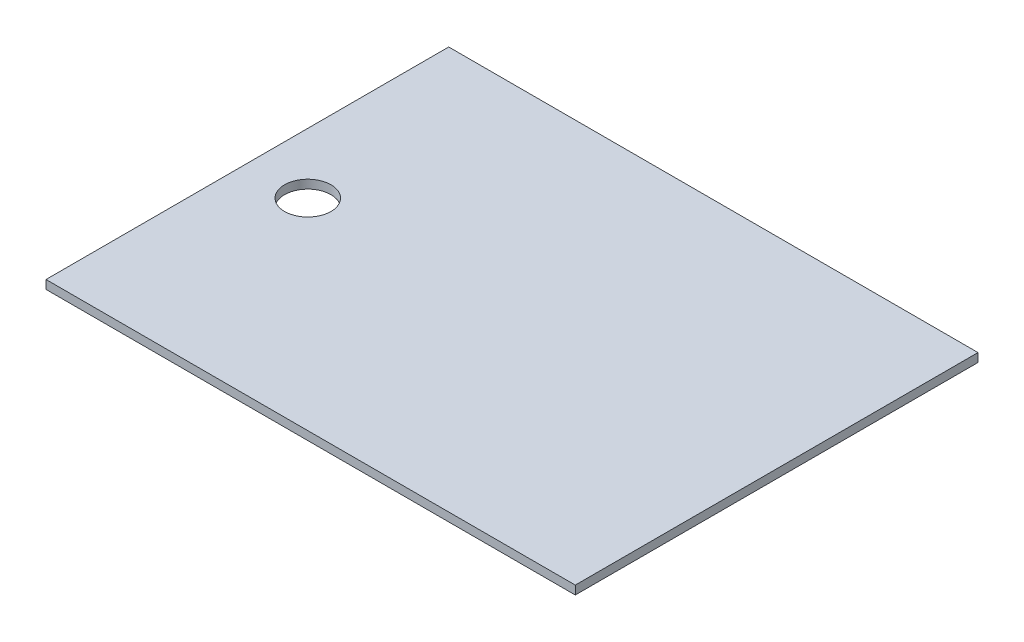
ISO-10303-21;
HEADER;
FILE_DESCRIPTION(('STEP AP214'),'2;1');
FILE_NAME('part.step','',(''),(''),'','','');
FILE_SCHEMA(('AUTOMOTIVE_DESIGN { 1 0 10303 214 1 1 1 1 }'));
ENDSEC;
DATA;
#1=APPLICATION_CONTEXT('core data for automotive mechanical design processes');
#2=APPLICATION_PROTOCOL_DEFINITION('international standard','automotive_design',2000,#1);
#3=PRODUCT_CONTEXT('',#1,'mechanical');
#4=PRODUCT('Part','Part','',(#3));
#5=PRODUCT_RELATED_PRODUCT_CATEGORY('part','',(#4));
#6=PRODUCT_DEFINITION_FORMATION('','',#4);
#7=PRODUCT_DEFINITION_CONTEXT('part definition',#1,'design');
#8=PRODUCT_DEFINITION('design','',#6,#7);
#9=PRODUCT_DEFINITION_SHAPE('','',#8);
#10=(LENGTH_UNIT() NAMED_UNIT(*) SI_UNIT(.MILLI.,.METRE.));
#11=(NAMED_UNIT(*) PLANE_ANGLE_UNIT() SI_UNIT($,.RADIAN.));
#12=(NAMED_UNIT(*) SI_UNIT($,.STERADIAN.) SOLID_ANGLE_UNIT());
#13=UNCERTAINTY_MEASURE_WITH_UNIT(LENGTH_MEASURE(1.E-05),#10,'distance_accuracy_value','');
#14=(GEOMETRIC_REPRESENTATION_CONTEXT(3) GLOBAL_UNCERTAINTY_ASSIGNED_CONTEXT((#13)) GLOBAL_UNIT_ASSIGNED_CONTEXT((#10,
#11,#12)) REPRESENTATION_CONTEXT('',''));
#15=CARTESIAN_POINT('',(0.,0.,0.));
#16=DIRECTION('',(0.,0.,1.));
#17=DIRECTION('',(1.,0.,0.));
#18=AXIS2_PLACEMENT_3D('',#15,#16,#17);
#19=CARTESIAN_POINT('',(584.2,19.05,-444.5));
#20=DIRECTION('',(-1.,0.,0.));
#21=DIRECTION('',(0.,0.,1.));
#22=AXIS2_PLACEMENT_3D('',#19,#20,#21);
#23=PLANE('',#22);
#24=DIRECTION('',(0.,0.,-1.));
#25=VECTOR('',#24,1.);
#26=CARTESIAN_POINT('',(584.2,0.,-444.5));
#27=LINE('',#26,#25);
#28=CARTESIAN_POINT('',(584.2,0.,444.5));
#29=VERTEX_POINT('',#28);
#30=CARTESIAN_POINT('',(584.2,0.,-444.5));
#31=VERTEX_POINT('',#30);
#32=EDGE_CURVE('E102',#29,#31,#27,.T.);
#33=ORIENTED_EDGE('',*,*,#32,.T.);
#34=DIRECTION('',(0.,-1.,0.));
#35=VECTOR('',#34,1.);
#36=CARTESIAN_POINT('',(584.2,19.05,-444.5));
#37=LINE('',#36,#35);
#38=CARTESIAN_POINT('',(584.2,19.05,-444.5));
#39=VERTEX_POINT('',#38);
#40=EDGE_CURVE('E11',#39,#31,#37,.T.);
#41=ORIENTED_EDGE('',*,*,#40,.F.);
#42=DIRECTION('',(0.,0.,-1.));
#43=VECTOR('',#42,1.);
#44=CARTESIAN_POINT('',(584.2,19.05,-444.5));
#45=LINE('',#44,#43);
#46=CARTESIAN_POINT('',(584.2,19.05,444.5));
#47=VERTEX_POINT('',#46);
#48=EDGE_CURVE('E90',#47,#39,#45,.T.);
#49=ORIENTED_EDGE('',*,*,#48,.F.);
#50=DIRECTION('',(0.,-1.,0.));
#51=VECTOR('',#50,1.);
#52=CARTESIAN_POINT('',(584.2,19.05,444.5));
#53=LINE('',#52,#51);
#54=EDGE_CURVE('E98',#47,#29,#53,.T.);
#55=ORIENTED_EDGE('',*,*,#54,.T.);
#56=EDGE_LOOP('',(#33,#41,#49,#55));
#57=FACE_BOUND('',#56,.T.);
#58=ADVANCED_FACE('F39',(#57),#23,.F.);
#59=CARTESIAN_POINT('',(-584.2,19.05,-444.5));
#60=DIRECTION('',(0.,0.,1.));
#61=DIRECTION('',(1.,0.,0.));
#62=AXIS2_PLACEMENT_3D('',#59,#60,#61);
#63=PLANE('',#62);
#64=DIRECTION('',(-1.,0.,0.));
#65=VECTOR('',#64,1.);
#66=CARTESIAN_POINT('',(-584.2,0.,-444.5));
#67=LINE('',#66,#65);
#68=CARTESIAN_POINT('',(-584.2,0.,-444.5));
#69=VERTEX_POINT('',#68);
#70=EDGE_CURVE('E94',#31,#69,#67,.T.);
#71=ORIENTED_EDGE('',*,*,#70,.T.);
#72=DIRECTION('',(0.,-1.,0.));
#73=VECTOR('',#72,1.);
#74=CARTESIAN_POINT('',(-584.2,19.05,-444.5));
#75=LINE('',#74,#73);
#76=CARTESIAN_POINT('',(-584.2,19.05,-444.5));
#77=VERTEX_POINT('',#76);
#78=EDGE_CURVE('E47',#77,#69,#75,.T.);
#79=ORIENTED_EDGE('',*,*,#78,.F.);
#80=DIRECTION('',(-1.,0.,0.));
#81=VECTOR('',#80,1.);
#82=CARTESIAN_POINT('',(-584.2,19.05,-444.5));
#83=LINE('',#82,#81);
#84=EDGE_CURVE('E85',#39,#77,#83,.T.);
#85=ORIENTED_EDGE('',*,*,#84,.F.);
#86=ORIENTED_EDGE('',*,*,#40,.T.);
#87=EDGE_LOOP('',(#71,#79,#85,#86));
#88=FACE_BOUND('',#87,.T.);
#89=ADVANCED_FACE('F93',(#88),#63,.F.);
#90=CARTESIAN_POINT('',(-584.2,19.05,-444.5));
#91=DIRECTION('',(1.,0.,0.));
#92=DIRECTION('',(0.,0.,-1.));
#93=AXIS2_PLACEMENT_3D('',#90,#91,#92);
#94=PLANE('',#93);
#95=DIRECTION('',(0.,0.,1.));
#96=VECTOR('',#95,1.);
#97=CARTESIAN_POINT('',(-584.2,0.,-444.5));
#98=LINE('',#97,#96);
#99=CARTESIAN_POINT('',(-584.2,0.,444.5));
#100=VERTEX_POINT('',#99);
#101=EDGE_CURVE('E72',#69,#100,#98,.T.);
#102=ORIENTED_EDGE('',*,*,#101,.T.);
#103=DIRECTION('',(0.,-1.,0.));
#104=VECTOR('',#103,1.);
#105=CARTESIAN_POINT('',(-584.2,19.05,444.5));
#106=LINE('',#105,#104);
#107=CARTESIAN_POINT('',(-584.2,19.05,444.5));
#108=VERTEX_POINT('',#107);
#109=EDGE_CURVE('E95',#108,#100,#106,.T.);
#110=ORIENTED_EDGE('',*,*,#109,.F.);
#111=DIRECTION('',(0.,0.,1.));
#112=VECTOR('',#111,1.);
#113=CARTESIAN_POINT('',(-584.2,19.05,-444.5));
#114=LINE('',#113,#112);
#115=EDGE_CURVE('E88',#77,#108,#114,.T.);
#116=ORIENTED_EDGE('',*,*,#115,.F.);
#117=ORIENTED_EDGE('',*,*,#78,.T.);
#118=EDGE_LOOP('',(#102,#110,#116,#117));
#119=FACE_BOUND('',#118,.T.);
#120=ADVANCED_FACE('F96',(#119),#94,.F.);
#121=CARTESIAN_POINT('',(-584.2,19.05,444.5));
#122=DIRECTION('',(0.,0.,-1.));
#123=DIRECTION('',(-1.,0.,0.));
#124=AXIS2_PLACEMENT_3D('',#121,#122,#123);
#125=PLANE('',#124);
#126=DIRECTION('',(1.,0.,0.));
#127=VECTOR('',#126,1.);
#128=CARTESIAN_POINT('',(-584.2,0.,444.5));
#129=LINE('',#128,#127);
#130=EDGE_CURVE('E78',#100,#29,#129,.T.);
#131=ORIENTED_EDGE('',*,*,#130,.T.);
#132=ORIENTED_EDGE('',*,*,#54,.F.);
#133=DIRECTION('',(1.,0.,0.));
#134=VECTOR('',#133,1.);
#135=CARTESIAN_POINT('',(-584.2,19.05,444.5));
#136=LINE('',#135,#134);
#137=EDGE_CURVE('E55',#108,#47,#136,.T.);
#138=ORIENTED_EDGE('',*,*,#137,.F.);
#139=ORIENTED_EDGE('',*,*,#109,.T.);
#140=EDGE_LOOP('',(#131,#132,#138,#139));
#141=FACE_BOUND('',#140,.T.);
#142=ADVANCED_FACE('F110',(#141),#125,.F.);
#143=CARTESIAN_POINT('',(0.,19.05,0.));
#144=DIRECTION('',(0.,1.,0.));
#145=DIRECTION('',(0.,0.,1.));
#146=AXIS2_PLACEMENT_3D('',#143,#144,#145);
#147=PLANE('',#146);
#148=CARTESIAN_POINT('',(-450.85,19.05,0.));
#149=DIRECTION('',(0.,1.,0.));
#150=DIRECTION('',(0.,0.,1.));
#151=AXIS2_PLACEMENT_3D('',#148,#149,#150);
#152=CIRCLE('',#151,51.181);
#153=CARTESIAN_POINT('',(-450.85,19.05,51.181));
#154=VERTEX_POINT('',#153);
#155=EDGE_CURVE('E116',#154,#154,#152,.T.);
#156=ORIENTED_EDGE('',*,*,#155,.F.);
#157=EDGE_LOOP('',(#156));
#158=FACE_BOUND('',#157,.T.);
#159=ORIENTED_EDGE('',*,*,#48,.T.);
#160=ORIENTED_EDGE('',*,*,#84,.T.);
#161=ORIENTED_EDGE('',*,*,#115,.T.);
#162=ORIENTED_EDGE('',*,*,#137,.T.);
#163=EDGE_LOOP('',(#159,#160,#161,#162));
#164=FACE_BOUND('',#163,.T.);
#165=ADVANCED_FACE('F86',(#158,#164),#147,.T.);
#166=CARTESIAN_POINT('',(0.,0.,0.));
#167=DIRECTION('',(0.,1.,0.));
#168=DIRECTION('',(0.,0.,1.));
#169=AXIS2_PLACEMENT_3D('',#166,#167,#168);
#170=PLANE('',#169);
#171=CARTESIAN_POINT('',(-450.85,0.,0.));
#172=DIRECTION('',(0.,1.,0.));
#173=DIRECTION('',(0.,0.,1.));
#174=AXIS2_PLACEMENT_3D('',#171,#172,#173);
#175=CIRCLE('',#174,51.181);
#176=CARTESIAN_POINT('',(-450.85,0.,51.181));
#177=VERTEX_POINT('',#176);
#178=EDGE_CURVE('E105',#177,#177,#175,.T.);
#179=ORIENTED_EDGE('',*,*,#178,.T.);
#180=EDGE_LOOP('',(#179));
#181=FACE_BOUND('',#180,.T.);
#182=ORIENTED_EDGE('',*,*,#32,.F.);
#183=ORIENTED_EDGE('',*,*,#130,.F.);
#184=ORIENTED_EDGE('',*,*,#101,.F.);
#185=ORIENTED_EDGE('',*,*,#70,.F.);
#186=EDGE_LOOP('',(#182,#183,#184,#185));
#187=FACE_BOUND('',#186,.T.);
#188=ADVANCED_FACE('F113',(#181,#187),#170,.F.);
#189=CARTESIAN_POINT('',(-450.85,0.,0.));
#190=DIRECTION('',(0.,1.,0.));
#191=DIRECTION('',(0.,0.,1.));
#192=AXIS2_PLACEMENT_3D('',#189,#190,#191);
#193=CYLINDRICAL_SURFACE('',#192,51.181);
#194=CARTESIAN_POINT('',(-450.85,0.,51.181));
#195=CARTESIAN_POINT('',(-450.85,0.1984375,51.181));
#196=CARTESIAN_POINT('',(-450.85,0.396875,51.181));
#197=CARTESIAN_POINT('',(-450.85,0.79375,51.181));
#198=CARTESIAN_POINT('',(-450.85,0.9921875,51.181));
#199=CARTESIAN_POINT('',(-450.85,1.3890625,51.181));
#200=CARTESIAN_POINT('',(-450.85,1.5875,51.181));
#201=CARTESIAN_POINT('',(-450.85,1.984375,51.181));
#202=CARTESIAN_POINT('',(-450.85,2.1828125,51.181));
#203=CARTESIAN_POINT('',(-450.85,2.5796875,51.181));
#204=CARTESIAN_POINT('',(-450.85,2.778125,51.181));
#205=CARTESIAN_POINT('',(-450.85,3.175,51.181));
#206=CARTESIAN_POINT('',(-450.85,3.3734375,51.181));
#207=CARTESIAN_POINT('',(-450.85,3.7703125,51.181));
#208=CARTESIAN_POINT('',(-450.85,3.96875,51.181));
#209=CARTESIAN_POINT('',(-450.85,4.365625,51.181));
#210=CARTESIAN_POINT('',(-450.85,4.5640625,51.181));
#211=CARTESIAN_POINT('',(-450.85,4.9609375,51.181));
#212=CARTESIAN_POINT('',(-450.85,5.159375,51.181));
#213=CARTESIAN_POINT('',(-450.85,5.55625,51.181));
#214=CARTESIAN_POINT('',(-450.85,5.7546875,51.181));
#215=CARTESIAN_POINT('',(-450.85,6.1515625,51.181));
#216=CARTESIAN_POINT('',(-450.85,6.35,51.181));
#217=CARTESIAN_POINT('',(-450.85,6.746875,51.181));
#218=CARTESIAN_POINT('',(-450.85,6.9453125,51.181));
#219=CARTESIAN_POINT('',(-450.85,7.3421875,51.181));
#220=CARTESIAN_POINT('',(-450.85,7.540625,51.181));
#221=CARTESIAN_POINT('',(-450.85,7.9375,51.181));
#222=CARTESIAN_POINT('',(-450.85,8.1359375,51.181));
#223=CARTESIAN_POINT('',(-450.85,8.5328125,51.181));
#224=CARTESIAN_POINT('',(-450.85,8.73125,51.181));
#225=CARTESIAN_POINT('',(-450.85,9.128125,51.181));
#226=CARTESIAN_POINT('',(-450.85,9.3265625,51.181));
#227=CARTESIAN_POINT('',(-450.85,9.7234375,51.181));
#228=CARTESIAN_POINT('',(-450.85,9.921875,51.181));
#229=CARTESIAN_POINT('',(-450.85,10.31875,51.181));
#230=CARTESIAN_POINT('',(-450.85,10.5171875,51.181));
#231=CARTESIAN_POINT('',(-450.85,10.9140625,51.181));
#232=CARTESIAN_POINT('',(-450.85,11.1125,51.181));
#233=CARTESIAN_POINT('',(-450.85,11.509375,51.181));
#234=CARTESIAN_POINT('',(-450.85,11.7078125,51.181));
#235=CARTESIAN_POINT('',(-450.85,12.1046875,51.181));
#236=CARTESIAN_POINT('',(-450.85,12.303125,51.181));
#237=CARTESIAN_POINT('',(-450.85,12.7,51.181));
#238=CARTESIAN_POINT('',(-450.85,12.8984375,51.181));
#239=CARTESIAN_POINT('',(-450.85,13.2953125,51.181));
#240=CARTESIAN_POINT('',(-450.85,13.49375,51.181));
#241=CARTESIAN_POINT('',(-450.85,13.890625,51.181));
#242=CARTESIAN_POINT('',(-450.85,14.0890625,51.181));
#243=CARTESIAN_POINT('',(-450.85,14.4859375,51.181));
#244=CARTESIAN_POINT('',(-450.85,14.684375,51.181));
#245=CARTESIAN_POINT('',(-450.85,15.08125,51.181));
#246=CARTESIAN_POINT('',(-450.85,15.2796875,51.181));
#247=CARTESIAN_POINT('',(-450.85,15.6765625,51.181));
#248=CARTESIAN_POINT('',(-450.85,15.875,51.181));
#249=CARTESIAN_POINT('',(-450.85,16.271875,51.181));
#250=CARTESIAN_POINT('',(-450.85,16.4703125,51.181));
#251=CARTESIAN_POINT('',(-450.85,16.8671875,51.181));
#252=CARTESIAN_POINT('',(-450.85,17.065625,51.181));
#253=CARTESIAN_POINT('',(-450.85,17.4625,51.181));
#254=CARTESIAN_POINT('',(-450.85,17.6609375,51.181));
#255=CARTESIAN_POINT('',(-450.85,18.0578125,51.181));
#256=CARTESIAN_POINT('',(-450.85,18.25625,51.181));
#257=CARTESIAN_POINT('',(-450.85,18.653125,51.181));
#258=CARTESIAN_POINT('',(-450.85,18.8515625,51.181));
#259=CARTESIAN_POINT('',(-450.85,19.05,51.181));
#260=B_SPLINE_CURVE_WITH_KNOTS('',3,(#194,#195,#196,#197,#198,#199,#200,#201,#202,#203,#204,
#205,#206,#207,#208,#209,#210,#211,#212,#213,#214,#215,#216,#217,#218,#219,#220,#221,#222,#223,
#224,#225,#226,#227,#228,#229,#230,#231,#232,#233,#234,#235,#236,#237,#238,#239,#240,#241,#242,
#243,#244,#245,#246,#247,#248,#249,#250,#251,#252,#253,#254,#255,#256,#257,#258,#259),
.UNSPECIFIED.,.F.,.F.,(4,2,2,2,2,2,2,2,2,2,2,2,2,2,2,2,2,2,2,2,2,2,2,2,2,2,2,2,2,2,2,2,4),(0.,
0.5953125,1.190625,1.7859375,2.38125,2.9765625,3.571875,4.1671875,4.7625,5.3578125,5.953125,
6.5484375,7.14375,7.7390625,8.334375,8.9296875,9.525,10.1203125,10.715625,11.3109375,11.90625,
12.5015625,13.096875,13.6921875,14.2875,14.8828125,15.478125,16.0734375,16.66875,17.2640625,
17.859375,18.4546875,19.05),.UNSPECIFIED.);
#261=EDGE_CURVE('BSEAM123',#177,#154,#260,.T.);
#262=ORIENTED_EDGE('',*,*,#178,.F.);
#263=ORIENTED_EDGE('',*,*,#155,.T.);
#264=ORIENTED_EDGE('',*,*,#261,.T.);
#265=ORIENTED_EDGE('',*,*,#261,.F.);
#266=EDGE_LOOP('',(#262,#264,#263,#265));
#267=FACE_BOUND('',#266,.T.);
#268=ADVANCED_FACE('F123',(#267),#193,.F.);
#269=CLOSED_SHELL('',(#58,#89,#120,#142,#165,#188,#268));
#270=MANIFOLD_SOLID_BREP('B2',#269);
#271=ADVANCED_BREP_SHAPE_REPRESENTATION('',(#18,#270),#14);
#272=SHAPE_DEFINITION_REPRESENTATION(#9,#271);
ENDSEC;
END-ISO-10303-21;
